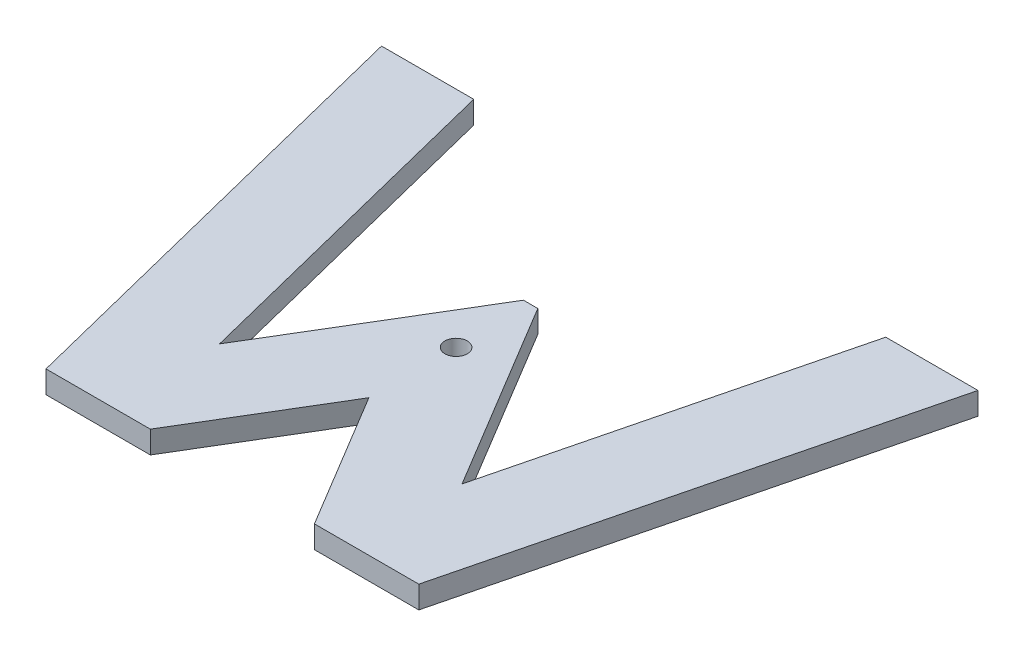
ISO-10303-21;
HEADER;
FILE_DESCRIPTION(('STEP AP214'),'2;1');
FILE_NAME('part.step','',(''),(''),'','','');
FILE_SCHEMA(('AUTOMOTIVE_DESIGN { 1 0 10303 214 1 1 1 1 }'));
ENDSEC;
DATA;
#1=APPLICATION_CONTEXT('core data for automotive mechanical design processes');
#2=APPLICATION_PROTOCOL_DEFINITION('international standard','automotive_design',2000,#1);
#3=PRODUCT_CONTEXT('',#1,'mechanical');
#4=PRODUCT('Part','Part','',(#3));
#5=PRODUCT_RELATED_PRODUCT_CATEGORY('part','',(#4));
#6=PRODUCT_DEFINITION_FORMATION('','',#4);
#7=PRODUCT_DEFINITION_CONTEXT('part definition',#1,'design');
#8=PRODUCT_DEFINITION('design','',#6,#7);
#9=PRODUCT_DEFINITION_SHAPE('','',#8);
#10=(LENGTH_UNIT() NAMED_UNIT(*) SI_UNIT(.MILLI.,.METRE.));
#11=(NAMED_UNIT(*) PLANE_ANGLE_UNIT() SI_UNIT($,.RADIAN.));
#12=(NAMED_UNIT(*) SI_UNIT($,.STERADIAN.) SOLID_ANGLE_UNIT());
#13=UNCERTAINTY_MEASURE_WITH_UNIT(LENGTH_MEASURE(1.E-05),#10,'distance_accuracy_value','');
#14=(GEOMETRIC_REPRESENTATION_CONTEXT(3) GLOBAL_UNCERTAINTY_ASSIGNED_CONTEXT((#13)) GLOBAL_UNIT_ASSIGNED_CONTEXT((#10,
#11,#12)) REPRESENTATION_CONTEXT('',''));
#15=CARTESIAN_POINT('',(0.,0.,0.));
#16=DIRECTION('',(0.,0.,1.));
#17=DIRECTION('',(1.,0.,0.));
#18=AXIS2_PLACEMENT_3D('',#15,#16,#17);
#19=CARTESIAN_POINT('',(12.369316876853,3.,-60.));
#20=DIRECTION('',(0.,-1.,0.));
#21=DIRECTION('',(0.,0.,-1.));
#22=AXIS2_PLACEMENT_3D('',#19,#20,#21);
#23=PLANE('',#22);
#24=DIRECTION('',(-1.,0.,0.));
#25=VECTOR('',#24,1.);
#26=CARTESIAN_POINT('',(67.6306831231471,3.,-60.));
#27=LINE('',#26,#25);
#28=CARTESIAN_POINT('',(80.,3.,-60.));
#29=VERTEX_POINT('',#28);
#30=CARTESIAN_POINT('',(67.6306831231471,3.,-60.));
#31=VERTEX_POINT('',#30);
#32=EDGE_CURVE('E172',#29,#31,#27,.T.);
#33=ORIENTED_EDGE('',*,*,#32,.T.);
#34=DIRECTION('',(-0.242535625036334,0.,0.970142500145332));
#35=VECTOR('',#34,1.);
#36=CARTESIAN_POINT('',(67.6306831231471,3.,-60.));
#37=LINE('',#36,#35);
#38=CARTESIAN_POINT('',(56.2647618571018,3.,-14.5363149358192));
#39=VERTEX_POINT('',#38);
#40=EDGE_CURVE('E139',#31,#39,#37,.T.);
#41=ORIENTED_EDGE('',*,*,#40,.T.);
#42=DIRECTION('',(-0.515078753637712,0.,-0.857142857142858));
#43=VECTOR('',#42,1.);
#44=CARTESIAN_POINT('',(56.2647618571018,3.,-14.5363149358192));
#45=LINE('',#44,#43);
#46=CARTESIAN_POINT('',(40.9629914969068,3.,-40.));
#47=VERTEX_POINT('',#46);
#48=EDGE_CURVE('E175',#39,#47,#45,.T.);
#49=ORIENTED_EDGE('',*,*,#48,.T.);
#50=DIRECTION('',(-1.,0.,0.));
#51=VECTOR('',#50,1.);
#52=CARTESIAN_POINT('',(39.0370085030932,3.,-40.));
#53=LINE('',#52,#51);
#54=CARTESIAN_POINT('',(39.0370085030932,3.,-40.));
#55=VERTEX_POINT('',#54);
#56=EDGE_CURVE('E177',#47,#55,#53,.T.);
#57=ORIENTED_EDGE('',*,*,#56,.T.);
#58=DIRECTION('',(-0.515078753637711,0.,0.857142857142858));
#59=VECTOR('',#58,1.);
#60=CARTESIAN_POINT('',(23.7352381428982,3.,-14.5363149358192));
#61=LINE('',#60,#59);
#62=CARTESIAN_POINT('',(23.7352381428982,3.,-14.5363149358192));
#63=VERTEX_POINT('',#62);
#64=EDGE_CURVE('E179',#55,#63,#61,.T.);
#65=ORIENTED_EDGE('',*,*,#64,.T.);
#66=DIRECTION('',(-0.242535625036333,0.,-0.970142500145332));
#67=VECTOR('',#66,1.);
#68=CARTESIAN_POINT('',(12.369316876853,3.,-60.));
#69=LINE('',#68,#67);
#70=CARTESIAN_POINT('',(12.369316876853,3.,-60.));
#71=VERTEX_POINT('',#70);
#72=EDGE_CURVE('E181',#63,#71,#69,.T.);
#73=ORIENTED_EDGE('',*,*,#72,.T.);
#74=DIRECTION('',(-1.,0.,0.));
#75=VECTOR('',#74,1.);
#76=CARTESIAN_POINT('',(0.,3.,-60.));
#77=LINE('',#76,#75);
#78=CARTESIAN_POINT('',(0.,3.,-60.));
#79=VERTEX_POINT('',#78);
#80=EDGE_CURVE('E183',#71,#79,#77,.T.);
#81=ORIENTED_EDGE('',*,*,#80,.T.);
#82=DIRECTION('',(0.242535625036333,0.,0.970142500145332));
#83=VECTOR('',#82,1.);
#84=CARTESIAN_POINT('',(0.,3.,-60.));
#85=LINE('',#84,#83);
#86=CARTESIAN_POINT('',(15.,3.,0.));
#87=VERTEX_POINT('',#86);
#88=EDGE_CURVE('E185',#79,#87,#85,.T.);
#89=ORIENTED_EDGE('',*,*,#88,.T.);
#90=DIRECTION('',(1.,0.,0.));
#91=VECTOR('',#90,1.);
#92=CARTESIAN_POINT('',(15.,3.,0.));
#93=LINE('',#92,#91);
#94=CARTESIAN_POINT('',(29.,3.,0.));
#95=VERTEX_POINT('',#94);
#96=EDGE_CURVE('E187',#87,#95,#93,.T.);
#97=ORIENTED_EDGE('',*,*,#96,.T.);
#98=DIRECTION('',(0.515078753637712,0.,-0.857142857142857));
#99=VECTOR('',#98,1.);
#100=CARTESIAN_POINT('',(29.,3.,0.));
#101=LINE('',#100,#99);
#102=CARTESIAN_POINT('',(40.,3.,-18.3051064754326));
#103=VERTEX_POINT('',#102);
#104=EDGE_CURVE('E189',#95,#103,#101,.T.);
#105=ORIENTED_EDGE('',*,*,#104,.T.);
#106=DIRECTION('',(0.515078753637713,0.,0.857142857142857));
#107=VECTOR('',#106,1.);
#108=CARTESIAN_POINT('',(51.,3.,0.));
#109=LINE('',#108,#107);
#110=CARTESIAN_POINT('',(51.,3.,0.));
#111=VERTEX_POINT('',#110);
#112=EDGE_CURVE('E191',#103,#111,#109,.T.);
#113=ORIENTED_EDGE('',*,*,#112,.T.);
#114=DIRECTION('',(1.,0.,0.));
#115=VECTOR('',#114,1.);
#116=CARTESIAN_POINT('',(51.,3.,0.));
#117=LINE('',#116,#115);
#118=CARTESIAN_POINT('',(65.,3.,0.));
#119=VERTEX_POINT('',#118);
#120=EDGE_CURVE('E50',#111,#119,#117,.T.);
#121=ORIENTED_EDGE('',*,*,#120,.T.);
#122=DIRECTION('',(0.242535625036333,0.,-0.970142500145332));
#123=VECTOR('',#122,1.);
#124=CARTESIAN_POINT('',(80.,3.,-60.));
#125=LINE('',#124,#123);
#126=EDGE_CURVE('E45',#119,#29,#125,.T.);
#127=ORIENTED_EDGE('',*,*,#126,.T.);
#128=EDGE_LOOP('',(#33,#41,#49,#57,#65,#73,#81,#89,#97,#105,#113,#121,#127));
#129=FACE_BOUND('',#128,.T.);
#130=CARTESIAN_POINT('',(40.,3.,-30.));
#131=DIRECTION('',(0.,1.,0.));
#132=DIRECTION('',(0.,0.,1.));
#133=AXIS2_PLACEMENT_3D('',#130,#131,#132);
#134=CIRCLE('',#133,1.5);
#135=CARTESIAN_POINT('',(40.,3.,-28.5));
#136=VERTEX_POINT('',#135);
#137=EDGE_CURVE('E144',#136,#136,#134,.T.);
#138=ORIENTED_EDGE('',*,*,#137,.F.);
#139=EDGE_LOOP('',(#138));
#140=FACE_BOUND('',#139,.T.);
#141=ADVANCED_FACE('F30',(#129,#140),#23,.F.);
#142=CARTESIAN_POINT('',(12.369316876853,0.,-60.));
#143=DIRECTION('',(0.,-1.,0.));
#144=DIRECTION('',(0.,0.,-1.));
#145=AXIS2_PLACEMENT_3D('',#142,#143,#144);
#146=PLANE('',#145);
#147=DIRECTION('',(-1.,0.,0.));
#148=VECTOR('',#147,1.);
#149=CARTESIAN_POINT('',(67.6306831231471,0.,-60.));
#150=LINE('',#149,#148);
#151=CARTESIAN_POINT('',(80.,0.,-60.));
#152=VERTEX_POINT('',#151);
#153=CARTESIAN_POINT('',(67.6306831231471,0.,-60.));
#154=VERTEX_POINT('',#153);
#155=EDGE_CURVE('E130',#152,#154,#150,.T.);
#156=ORIENTED_EDGE('',*,*,#155,.F.);
#157=DIRECTION('',(0.242535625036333,0.,-0.970142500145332));
#158=VECTOR('',#157,1.);
#159=CARTESIAN_POINT('',(80.,0.,-60.));
#160=LINE('',#159,#158);
#161=CARTESIAN_POINT('',(65.,0.,0.));
#162=VERTEX_POINT('',#161);
#163=EDGE_CURVE('E170',#162,#152,#160,.T.);
#164=ORIENTED_EDGE('',*,*,#163,.F.);
#165=DIRECTION('',(1.,0.,0.));
#166=VECTOR('',#165,1.);
#167=CARTESIAN_POINT('',(51.,0.,0.));
#168=LINE('',#167,#166);
#169=CARTESIAN_POINT('',(51.,0.,0.));
#170=VERTEX_POINT('',#169);
#171=EDGE_CURVE('E168',#170,#162,#168,.T.);
#172=ORIENTED_EDGE('',*,*,#171,.F.);
#173=DIRECTION('',(0.515078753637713,0.,0.857142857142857));
#174=VECTOR('',#173,1.);
#175=CARTESIAN_POINT('',(51.,0.,0.));
#176=LINE('',#175,#174);
#177=CARTESIAN_POINT('',(40.,0.,-18.3051064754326));
#178=VERTEX_POINT('',#177);
#179=EDGE_CURVE('E166',#178,#170,#176,.T.);
#180=ORIENTED_EDGE('',*,*,#179,.F.);
#181=DIRECTION('',(0.515078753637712,0.,-0.857142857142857));
#182=VECTOR('',#181,1.);
#183=CARTESIAN_POINT('',(29.,0.,0.));
#184=LINE('',#183,#182);
#185=CARTESIAN_POINT('',(29.,0.,0.));
#186=VERTEX_POINT('',#185);
#187=EDGE_CURVE('E164',#186,#178,#184,.T.);
#188=ORIENTED_EDGE('',*,*,#187,.F.);
#189=DIRECTION('',(1.,0.,0.));
#190=VECTOR('',#189,1.);
#191=CARTESIAN_POINT('',(15.,0.,0.));
#192=LINE('',#191,#190);
#193=CARTESIAN_POINT('',(15.,0.,0.));
#194=VERTEX_POINT('',#193);
#195=EDGE_CURVE('E162',#194,#186,#192,.T.);
#196=ORIENTED_EDGE('',*,*,#195,.F.);
#197=DIRECTION('',(0.242535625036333,0.,0.970142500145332));
#198=VECTOR('',#197,1.);
#199=CARTESIAN_POINT('',(0.,0.,-60.));
#200=LINE('',#199,#198);
#201=CARTESIAN_POINT('',(0.,0.,-60.));
#202=VERTEX_POINT('',#201);
#203=EDGE_CURVE('E160',#202,#194,#200,.T.);
#204=ORIENTED_EDGE('',*,*,#203,.F.);
#205=DIRECTION('',(-1.,0.,0.));
#206=VECTOR('',#205,1.);
#207=CARTESIAN_POINT('',(0.,0.,-60.));
#208=LINE('',#207,#206);
#209=CARTESIAN_POINT('',(12.369316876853,0.,-60.));
#210=VERTEX_POINT('',#209);
#211=EDGE_CURVE('E158',#210,#202,#208,.T.);
#212=ORIENTED_EDGE('',*,*,#211,.F.);
#213=DIRECTION('',(-0.242535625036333,0.,-0.970142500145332));
#214=VECTOR('',#213,1.);
#215=CARTESIAN_POINT('',(12.369316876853,0.,-60.));
#216=LINE('',#215,#214);
#217=CARTESIAN_POINT('',(23.7352381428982,0.,-14.5363149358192));
#218=VERTEX_POINT('',#217);
#219=EDGE_CURVE('E156',#218,#210,#216,.T.);
#220=ORIENTED_EDGE('',*,*,#219,.F.);
#221=DIRECTION('',(-0.515078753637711,0.,0.857142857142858));
#222=VECTOR('',#221,1.);
#223=CARTESIAN_POINT('',(23.7352381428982,0.,-14.5363149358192));
#224=LINE('',#223,#222);
#225=CARTESIAN_POINT('',(39.0370085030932,0.,-40.));
#226=VERTEX_POINT('',#225);
#227=EDGE_CURVE('E154',#226,#218,#224,.T.);
#228=ORIENTED_EDGE('',*,*,#227,.F.);
#229=DIRECTION('',(-1.,0.,0.));
#230=VECTOR('',#229,1.);
#231=CARTESIAN_POINT('',(39.0370085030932,0.,-40.));
#232=LINE('',#231,#230);
#233=CARTESIAN_POINT('',(40.9629914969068,0.,-40.));
#234=VERTEX_POINT('',#233);
#235=EDGE_CURVE('E152',#234,#226,#232,.T.);
#236=ORIENTED_EDGE('',*,*,#235,.F.);
#237=DIRECTION('',(-0.515078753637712,0.,-0.857142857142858));
#238=VECTOR('',#237,1.);
#239=CARTESIAN_POINT('',(56.2647618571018,0.,-14.5363149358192));
#240=LINE('',#239,#238);
#241=CARTESIAN_POINT('',(56.2647618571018,0.,-14.5363149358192));
#242=VERTEX_POINT('',#241);
#243=EDGE_CURVE('E132',#242,#234,#240,.T.);
#244=ORIENTED_EDGE('',*,*,#243,.F.);
#245=DIRECTION('',(-0.242535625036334,0.,0.970142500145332));
#246=VECTOR('',#245,1.);
#247=CARTESIAN_POINT('',(67.6306831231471,0.,-60.));
#248=LINE('',#247,#246);
#249=EDGE_CURVE('E125',#154,#242,#248,.T.);
#250=ORIENTED_EDGE('',*,*,#249,.F.);
#251=EDGE_LOOP('',(#156,#164,#172,#180,#188,#196,#204,#212,#220,#228,#236,#244,#250));
#252=FACE_BOUND('',#251,.T.);
#253=CARTESIAN_POINT('',(40.,0.,-30.));
#254=DIRECTION('',(0.,1.,0.));
#255=DIRECTION('',(0.,0.,1.));
#256=AXIS2_PLACEMENT_3D('',#253,#254,#255);
#257=CIRCLE('',#256,1.5);
#258=CARTESIAN_POINT('',(40.,0.,-28.5));
#259=VERTEX_POINT('',#258);
#260=EDGE_CURVE('E147',#259,#259,#257,.T.);
#261=ORIENTED_EDGE('',*,*,#260,.T.);
#262=EDGE_LOOP('',(#261));
#263=FACE_BOUND('',#262,.T.);
#264=ADVANCED_FACE('F126',(#252,#263),#146,.T.);
#265=CARTESIAN_POINT('',(67.6306831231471,3.,-60.));
#266=DIRECTION('',(0.,0.,1.));
#267=DIRECTION('',(1.,0.,0.));
#268=AXIS2_PLACEMENT_3D('',#265,#266,#267);
#269=PLANE('',#268);
#270=ORIENTED_EDGE('',*,*,#155,.T.);
#271=DIRECTION('',(0.,-1.,0.));
#272=VECTOR('',#271,1.);
#273=CARTESIAN_POINT('',(67.6306831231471,3.,-60.));
#274=LINE('',#273,#272);
#275=EDGE_CURVE('E11',#31,#154,#274,.T.);
#276=ORIENTED_EDGE('',*,*,#275,.F.);
#277=ORIENTED_EDGE('',*,*,#32,.F.);
#278=DIRECTION('',(0.,-1.,0.));
#279=VECTOR('',#278,1.);
#280=CARTESIAN_POINT('',(80.,3.,-60.));
#281=LINE('',#280,#279);
#282=EDGE_CURVE('E143',#29,#152,#281,.T.);
#283=ORIENTED_EDGE('',*,*,#282,.T.);
#284=EDGE_LOOP('',(#270,#276,#277,#283));
#285=FACE_BOUND('',#284,.T.);
#286=ADVANCED_FACE('F32',(#285),#269,.F.);
#287=CARTESIAN_POINT('',(67.6306831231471,3.,-60.));
#288=DIRECTION('',(0.970142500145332,0.,0.242535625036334));
#289=DIRECTION('',(0.242535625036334,0.,-0.970142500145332));
#290=AXIS2_PLACEMENT_3D('',#287,#288,#289);
#291=PLANE('',#290);
#292=ORIENTED_EDGE('',*,*,#249,.T.);
#293=DIRECTION('',(0.,-1.,0.));
#294=VECTOR('',#293,1.);
#295=CARTESIAN_POINT('',(56.2647618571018,3.,-14.5363149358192));
#296=LINE('',#295,#294);
#297=EDGE_CURVE('E38',#39,#242,#296,.T.);
#298=ORIENTED_EDGE('',*,*,#297,.F.);
#299=ORIENTED_EDGE('',*,*,#40,.F.);
#300=ORIENTED_EDGE('',*,*,#275,.T.);
#301=EDGE_LOOP('',(#292,#298,#299,#300));
#302=FACE_BOUND('',#301,.T.);
#303=ADVANCED_FACE('F138',(#302),#291,.F.);
#304=CARTESIAN_POINT('',(56.2647618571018,3.,-14.5363149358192));
#305=DIRECTION('',(-0.857142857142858,0.,0.515078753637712));
#306=DIRECTION('',(0.515078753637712,0.,0.857142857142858));
#307=AXIS2_PLACEMENT_3D('',#304,#305,#306);
#308=PLANE('',#307);
#309=ORIENTED_EDGE('',*,*,#243,.T.);
#310=DIRECTION('',(0.,-1.,0.));
#311=VECTOR('',#310,1.);
#312=CARTESIAN_POINT('',(40.9629914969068,3.,-40.));
#313=LINE('',#312,#311);
#314=EDGE_CURVE('E223',#47,#234,#313,.T.);
#315=ORIENTED_EDGE('',*,*,#314,.F.);
#316=ORIENTED_EDGE('',*,*,#48,.F.);
#317=ORIENTED_EDGE('',*,*,#297,.T.);
#318=EDGE_LOOP('',(#309,#315,#316,#317));
#319=FACE_BOUND('',#318,.T.);
#320=ADVANCED_FACE('F227',(#319),#308,.F.);
#321=CARTESIAN_POINT('',(39.0370085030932,3.,-40.));
#322=DIRECTION('',(0.,0.,1.));
#323=DIRECTION('',(1.,0.,0.));
#324=AXIS2_PLACEMENT_3D('',#321,#322,#323);
#325=PLANE('',#324);
#326=ORIENTED_EDGE('',*,*,#235,.T.);
#327=DIRECTION('',(0.,-1.,0.));
#328=VECTOR('',#327,1.);
#329=CARTESIAN_POINT('',(39.0370085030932,3.,-40.));
#330=LINE('',#329,#328);
#331=EDGE_CURVE('E220',#55,#226,#330,.T.);
#332=ORIENTED_EDGE('',*,*,#331,.F.);
#333=ORIENTED_EDGE('',*,*,#56,.F.);
#334=ORIENTED_EDGE('',*,*,#314,.T.);
#335=EDGE_LOOP('',(#326,#332,#333,#334));
#336=FACE_BOUND('',#335,.T.);
#337=ADVANCED_FACE('F235',(#336),#325,.F.);
#338=CARTESIAN_POINT('',(23.7352381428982,3.,-14.5363149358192));
#339=DIRECTION('',(0.857142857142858,0.,0.515078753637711));
#340=DIRECTION('',(0.515078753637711,0.,-0.857142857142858));
#341=AXIS2_PLACEMENT_3D('',#338,#339,#340);
#342=PLANE('',#341);
#343=ORIENTED_EDGE('',*,*,#227,.T.);
#344=DIRECTION('',(0.,-1.,0.));
#345=VECTOR('',#344,1.);
#346=CARTESIAN_POINT('',(23.7352381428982,3.,-14.5363149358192));
#347=LINE('',#346,#345);
#348=EDGE_CURVE('E217',#63,#218,#347,.T.);
#349=ORIENTED_EDGE('',*,*,#348,.F.);
#350=ORIENTED_EDGE('',*,*,#64,.F.);
#351=ORIENTED_EDGE('',*,*,#331,.T.);
#352=EDGE_LOOP('',(#343,#349,#350,#351));
#353=FACE_BOUND('',#352,.T.);
#354=ADVANCED_FACE('F238',(#353),#342,.F.);
#355=CARTESIAN_POINT('',(12.369316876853,3.,-60.));
#356=DIRECTION('',(-0.970142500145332,0.,0.242535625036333));
#357=DIRECTION('',(0.242535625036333,0.,0.970142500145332));
#358=AXIS2_PLACEMENT_3D('',#355,#356,#357);
#359=PLANE('',#358);
#360=ORIENTED_EDGE('',*,*,#219,.T.);
#361=DIRECTION('',(0.,-1.,0.));
#362=VECTOR('',#361,1.);
#363=CARTESIAN_POINT('',(12.369316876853,3.,-60.));
#364=LINE('',#363,#362);
#365=EDGE_CURVE('E214',#71,#210,#364,.T.);
#366=ORIENTED_EDGE('',*,*,#365,.F.);
#367=ORIENTED_EDGE('',*,*,#72,.F.);
#368=ORIENTED_EDGE('',*,*,#348,.T.);
#369=EDGE_LOOP('',(#360,#366,#367,#368));
#370=FACE_BOUND('',#369,.T.);
#371=ADVANCED_FACE('F243',(#370),#359,.F.);
#372=CARTESIAN_POINT('',(0.,3.,-60.));
#373=DIRECTION('',(0.,0.,1.));
#374=DIRECTION('',(1.,0.,0.));
#375=AXIS2_PLACEMENT_3D('',#372,#373,#374);
#376=PLANE('',#375);
#377=ORIENTED_EDGE('',*,*,#211,.T.);
#378=DIRECTION('',(0.,-1.,0.));
#379=VECTOR('',#378,1.);
#380=CARTESIAN_POINT('',(0.,3.,-60.));
#381=LINE('',#380,#379);
#382=EDGE_CURVE('E211',#79,#202,#381,.T.);
#383=ORIENTED_EDGE('',*,*,#382,.F.);
#384=ORIENTED_EDGE('',*,*,#80,.F.);
#385=ORIENTED_EDGE('',*,*,#365,.T.);
#386=EDGE_LOOP('',(#377,#383,#384,#385));
#387=FACE_BOUND('',#386,.T.);
#388=ADVANCED_FACE('F249',(#387),#376,.F.);
#389=CARTESIAN_POINT('',(0.,3.,-60.));
#390=DIRECTION('',(0.970142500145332,0.,-0.242535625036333));
#391=DIRECTION('',(-0.242535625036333,0.,-0.970142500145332));
#392=AXIS2_PLACEMENT_3D('',#389,#390,#391);
#393=PLANE('',#392);
#394=ORIENTED_EDGE('',*,*,#203,.T.);
#395=DIRECTION('',(0.,-1.,0.));
#396=VECTOR('',#395,1.);
#397=CARTESIAN_POINT('',(15.,3.,0.));
#398=LINE('',#397,#396);
#399=EDGE_CURVE('E208',#87,#194,#398,.T.);
#400=ORIENTED_EDGE('',*,*,#399,.F.);
#401=ORIENTED_EDGE('',*,*,#88,.F.);
#402=ORIENTED_EDGE('',*,*,#382,.T.);
#403=EDGE_LOOP('',(#394,#400,#401,#402));
#404=FACE_BOUND('',#403,.T.);
#405=ADVANCED_FACE('F253',(#404),#393,.F.);
#406=CARTESIAN_POINT('',(15.,3.,0.));
#407=DIRECTION('',(0.,0.,-1.));
#408=DIRECTION('',(-1.,0.,0.));
#409=AXIS2_PLACEMENT_3D('',#406,#407,#408);
#410=PLANE('',#409);
#411=ORIENTED_EDGE('',*,*,#195,.T.);
#412=DIRECTION('',(0.,-1.,0.));
#413=VECTOR('',#412,1.);
#414=CARTESIAN_POINT('',(29.,3.,0.));
#415=LINE('',#414,#413);
#416=EDGE_CURVE('E205',#95,#186,#415,.T.);
#417=ORIENTED_EDGE('',*,*,#416,.F.);
#418=ORIENTED_EDGE('',*,*,#96,.F.);
#419=ORIENTED_EDGE('',*,*,#399,.T.);
#420=EDGE_LOOP('',(#411,#417,#418,#419));
#421=FACE_BOUND('',#420,.T.);
#422=ADVANCED_FACE('F258',(#421),#410,.F.);
#423=CARTESIAN_POINT('',(29.,3.,0.));
#424=DIRECTION('',(-0.857142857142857,0.,-0.515078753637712));
#425=DIRECTION('',(-0.515078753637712,0.,0.857142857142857));
#426=AXIS2_PLACEMENT_3D('',#423,#424,#425);
#427=PLANE('',#426);
#428=ORIENTED_EDGE('',*,*,#187,.T.);
#429=DIRECTION('',(0.,-1.,0.));
#430=VECTOR('',#429,1.);
#431=CARTESIAN_POINT('',(40.,3.,-18.3051064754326));
#432=LINE('',#431,#430);
#433=EDGE_CURVE('E202',#103,#178,#432,.T.);
#434=ORIENTED_EDGE('',*,*,#433,.F.);
#435=ORIENTED_EDGE('',*,*,#104,.F.);
#436=ORIENTED_EDGE('',*,*,#416,.T.);
#437=EDGE_LOOP('',(#428,#434,#435,#436));
#438=FACE_BOUND('',#437,.T.);
#439=ADVANCED_FACE('F264',(#438),#427,.F.);
#440=CARTESIAN_POINT('',(51.,3.,0.));
#441=DIRECTION('',(0.857142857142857,0.,-0.515078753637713));
#442=DIRECTION('',(-0.515078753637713,0.,-0.857142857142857));
#443=AXIS2_PLACEMENT_3D('',#440,#441,#442);
#444=PLANE('',#443);
#445=ORIENTED_EDGE('',*,*,#179,.T.);
#446=DIRECTION('',(0.,-1.,0.));
#447=VECTOR('',#446,1.);
#448=CARTESIAN_POINT('',(51.,3.,0.));
#449=LINE('',#448,#447);
#450=EDGE_CURVE('E199',#111,#170,#449,.T.);
#451=ORIENTED_EDGE('',*,*,#450,.F.);
#452=ORIENTED_EDGE('',*,*,#112,.F.);
#453=ORIENTED_EDGE('',*,*,#433,.T.);
#454=EDGE_LOOP('',(#445,#451,#452,#453));
#455=FACE_BOUND('',#454,.T.);
#456=ADVANCED_FACE('F268',(#455),#444,.F.);
#457=CARTESIAN_POINT('',(51.,3.,0.));
#458=DIRECTION('',(0.,0.,-1.));
#459=DIRECTION('',(-1.,0.,0.));
#460=AXIS2_PLACEMENT_3D('',#457,#458,#459);
#461=PLANE('',#460);
#462=ORIENTED_EDGE('',*,*,#171,.T.);
#463=DIRECTION('',(0.,-1.,0.));
#464=VECTOR('',#463,1.);
#465=CARTESIAN_POINT('',(65.,3.,0.));
#466=LINE('',#465,#464);
#467=EDGE_CURVE('E196',#119,#162,#466,.T.);
#468=ORIENTED_EDGE('',*,*,#467,.F.);
#469=ORIENTED_EDGE('',*,*,#120,.F.);
#470=ORIENTED_EDGE('',*,*,#450,.T.);
#471=EDGE_LOOP('',(#462,#468,#469,#470));
#472=FACE_BOUND('',#471,.T.);
#473=ADVANCED_FACE('F271',(#472),#461,.F.);
#474=CARTESIAN_POINT('',(80.,3.,-60.));
#475=DIRECTION('',(-0.970142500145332,0.,-0.242535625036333));
#476=DIRECTION('',(-0.242535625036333,0.,0.970142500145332));
#477=AXIS2_PLACEMENT_3D('',#474,#475,#476);
#478=PLANE('',#477);
#479=ORIENTED_EDGE('',*,*,#163,.T.);
#480=ORIENTED_EDGE('',*,*,#282,.F.);
#481=ORIENTED_EDGE('',*,*,#126,.F.);
#482=ORIENTED_EDGE('',*,*,#467,.T.);
#483=EDGE_LOOP('',(#479,#480,#481,#482));
#484=FACE_BOUND('',#483,.T.);
#485=ADVANCED_FACE('F273',(#484),#478,.F.);
#486=CARTESIAN_POINT('',(40.,3.,-30.));
#487=DIRECTION('',(0.,-1.,0.));
#488=DIRECTION('',(0.,0.,-1.));
#489=AXIS2_PLACEMENT_3D('',#486,#487,#488);
#490=CYLINDRICAL_SURFACE('',#489,1.5);
#491=ORIENTED_EDGE('',*,*,#137,.T.);
#492=EDGE_LOOP('',(#491));
#493=FACE_BOUND('',#492,.T.);
#494=ORIENTED_EDGE('',*,*,#260,.F.);
#495=EDGE_LOOP('',(#494));
#496=FACE_BOUND('',#495,.T.);
#497=ADVANCED_FACE('F275',(#493,#496),#490,.F.);
#498=CLOSED_SHELL('',(#141,#264,#286,#303,#320,#337,#354,#371,#388,#405,#422,#439,#456,#473,
#485,#497));
#499=MANIFOLD_SOLID_BREP('B2',#498);
#500=ADVANCED_BREP_SHAPE_REPRESENTATION('',(#18,#499),#14);
#501=SHAPE_DEFINITION_REPRESENTATION(#9,#500);
ENDSEC;
END-ISO-10303-21;
